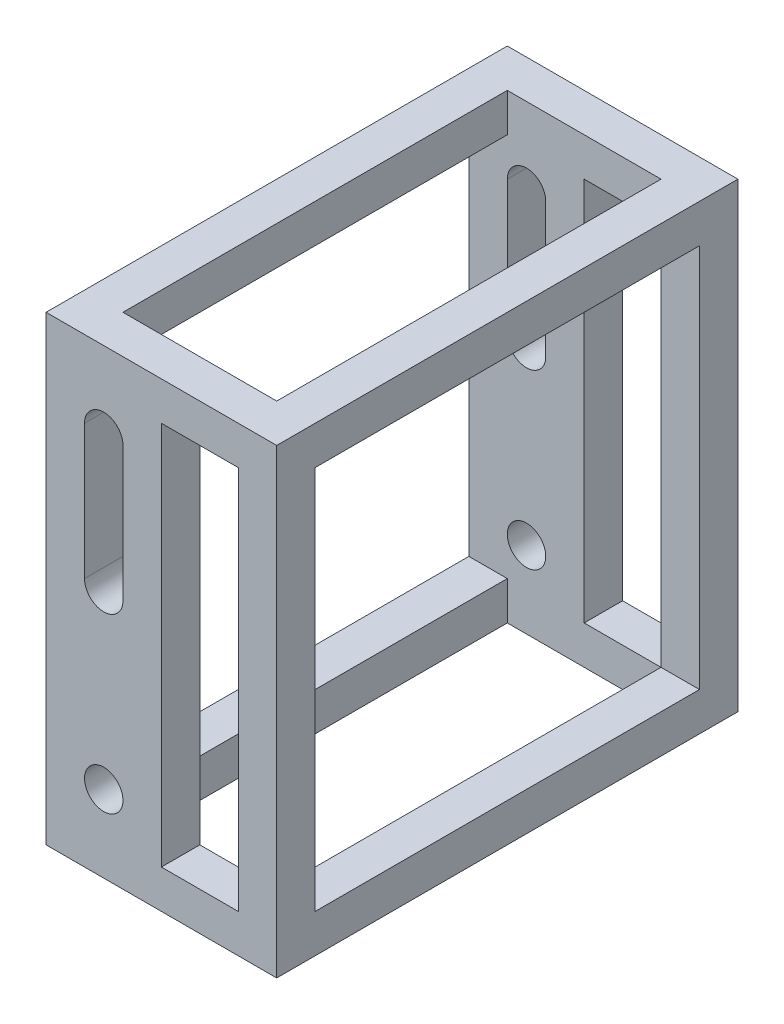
from build123d import *

# Parameters (mm, degrees)
SKETCH2_W           = 76.2
SKETCH2_H           = 152.4
BOSS_EXTRUDE1_DEPTH = 152.4
SKETCH3_W           = 50.8
SKETCH3_H           = 127
CUT_EXTRUDE1_DEPTH  = 229.6
SKETCH4_W           = 127
SKETCH4_H           = 127
CUT_EXTRUDE2_DEPTH  = 229.6
SKETCH5_R           = 6.35
CUT_EXTRUDE3_DEPTH  = 229.6
SKETCH6_W           = 25.4
SKETCH6_H           = 127
CUT_EXTRUDE4_DEPTH  = 229.6


with BuildPart() as part:
    # Sketch2 → Boss-Extrude1 (new body)
    with BuildSketch(Plane.XY):
        with Locations((38.1, 76.2)):
            Rectangle(SKETCH2_W, SKETCH2_H)
    extrude(amount=BOSS_EXTRUDE1_DEPTH)

    # Sketch3 → Cut-Extrude1 (cut, through all)
    with BuildSketch(Plane(origin=(0, 152.4, 0), x_dir=(1, 0, 0), z_dir=(0, 1, 0))):
        with Locations((38.1, -76.2)):
            Rectangle(SKETCH3_W, SKETCH3_H)
    extrude(amount=-CUT_EXTRUDE1_DEPTH, mode=Mode.SUBTRACT)

    # Sketch4 → Cut-Extrude2 (cut, through all)
    with BuildSketch(Plane(origin=(76.2, 0, 0), x_dir=(0, 0, -1), z_dir=(1, 0, 0))):
        with Locations((-76.2, 76.2)):
            Rectangle(SKETCH4_W, SKETCH4_H)
    extrude(amount=-CUT_EXTRUDE2_DEPTH, mode=Mode.SUBTRACT)

    # Sketch5 → Cut-Extrude3 (cut, through all)
    with BuildSketch(Plane.XY.offset(152.4)):
        with Locations((19.05, 25.4)):
            Circle(SKETCH5_R)
        with BuildLine():
            Line((12.7, 127), (12.7, 82.55))
            ThreePointArc((12.7, 82.55), (19.05, 76.2), (25.4, 82.55))
            Line((25.4, 82.55), (25.4, 127))
            ThreePointArc((25.4, 127), (19.05, 133.35), (12.7, 127))
        make_face()
    extrude(amount=-CUT_EXTRUDE3_DEPTH, mode=Mode.SUBTRACT)

    # Sketch6 → Cut-Extrude4 (cut, through all)
    with BuildSketch(Plane.XY.offset(152.4)):
        with Locations((50.8, 76.2)):
            Rectangle(SKETCH6_W, SKETCH6_H)
    extrude(amount=-CUT_EXTRUDE4_DEPTH, mode=Mode.SUBTRACT)


solid = part.part
